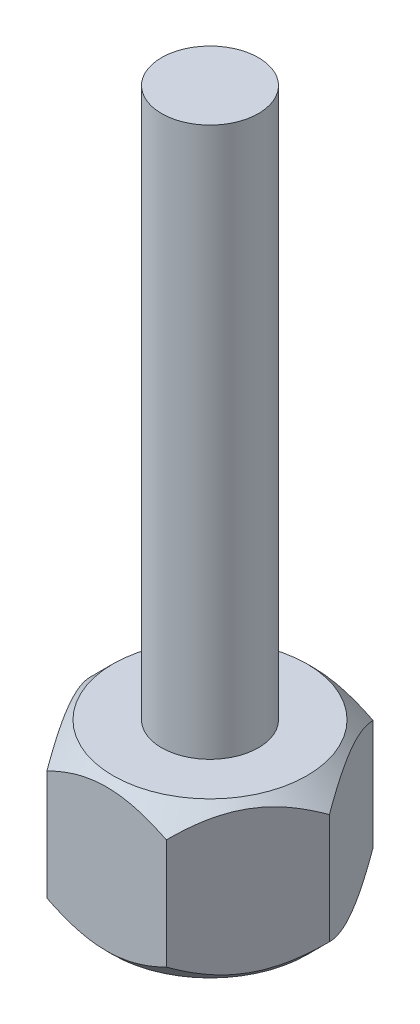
ISO-10303-21;
HEADER;
FILE_DESCRIPTION(('STEP AP214'),'2;1');
FILE_NAME('part.step','',(''),(''),'','','');
FILE_SCHEMA(('AUTOMOTIVE_DESIGN { 1 0 10303 214 1 1 1 1 }'));
ENDSEC;
DATA;
#1=APPLICATION_CONTEXT('core data for automotive mechanical design processes');
#2=APPLICATION_PROTOCOL_DEFINITION('international standard','automotive_design',2000,#1);
#3=PRODUCT_CONTEXT('',#1,'mechanical');
#4=PRODUCT('Part','Part','',(#3));
#5=PRODUCT_RELATED_PRODUCT_CATEGORY('part','',(#4));
#6=PRODUCT_DEFINITION_FORMATION('','',#4);
#7=PRODUCT_DEFINITION_CONTEXT('part definition',#1,'design');
#8=PRODUCT_DEFINITION('design','',#6,#7);
#9=PRODUCT_DEFINITION_SHAPE('','',#8);
#10=(LENGTH_UNIT() NAMED_UNIT(*) SI_UNIT(.MILLI.,.METRE.));
#11=(NAMED_UNIT(*) PLANE_ANGLE_UNIT() SI_UNIT($,.RADIAN.));
#12=(NAMED_UNIT(*) SI_UNIT($,.STERADIAN.) SOLID_ANGLE_UNIT());
#13=UNCERTAINTY_MEASURE_WITH_UNIT(LENGTH_MEASURE(1.E-05),#10,'distance_accuracy_value','');
#14=(GEOMETRIC_REPRESENTATION_CONTEXT(3) GLOBAL_UNCERTAINTY_ASSIGNED_CONTEXT((#13)) GLOBAL_UNIT_ASSIGNED_CONTEXT((#10,
#11,#12)) REPRESENTATION_CONTEXT('',''));
#15=CARTESIAN_POINT('',(0.,0.,0.));
#16=DIRECTION('',(0.,0.,1.));
#17=DIRECTION('',(1.,0.,0.));
#18=AXIS2_PLACEMENT_3D('',#15,#16,#17);
#19=CARTESIAN_POINT('',(2.30940107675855,3.,3.99999999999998));
#20=DIRECTION('',(-0.866025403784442,0.,-0.499999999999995));
#21=DIRECTION('',(-0.499999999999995,0.,0.866025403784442));
#22=AXIS2_PLACEMENT_3D('',#19,#20,#21);
#23=PLANE('',#22);
#24=CARTESIAN_POINT('',(4.61891762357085,-2.13108237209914,-0.0002));
#25=CARTESIAN_POINT('',(4.57920690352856,-2.17078899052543,0.0685809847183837));
#26=CARTESIAN_POINT('',(4.53919230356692,-2.20927742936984,0.137888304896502));
#27=CARTESIAN_POINT('',(4.45849274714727,-2.28344662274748,0.277664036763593));
#28=CARTESIAN_POINT('',(4.41780743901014,-2.31912584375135,0.348133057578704));
#29=CARTESIAN_POINT('',(4.29427352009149,-2.421696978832,0.5621000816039));
#30=CARTESIAN_POINT('',(4.21037499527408,-2.48368473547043,0.707416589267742));
#31=CARTESIAN_POINT('',(4.04121970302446,-2.58984197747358,1.00040214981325));
#32=CARTESIAN_POINT('',(3.95600566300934,-2.63427879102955,1.14799719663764));
#33=CARTESIAN_POINT('',(3.7836959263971,-2.70274886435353,1.44644641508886));
#34=CARTESIAN_POINT('',(3.69660550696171,-2.72683320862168,1.59729144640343));
#35=CARTESIAN_POINT('',(3.54650860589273,-2.74856296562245,1.85726690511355));
#36=CARTESIAN_POINT('',(3.48369550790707,-2.75177893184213,1.96606238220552));
#37=CARTESIAN_POINT('',(3.35817126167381,-2.74635778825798,2.18347675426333));
#38=CARTESIAN_POINT('',(3.2954601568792,-2.73771652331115,2.29209557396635));
#39=CARTESIAN_POINT('',(3.17063214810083,-2.70907380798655,2.50830402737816));
#40=CARTESIAN_POINT('',(3.10851598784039,-2.68905965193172,2.61589237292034));
#41=CARTESIAN_POINT('',(2.98535047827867,-2.63876368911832,2.82922129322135));
#42=CARTESIAN_POINT('',(2.92430104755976,-2.60848266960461,2.93496200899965));
#43=CARTESIAN_POINT('',(2.81592361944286,-2.54618259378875,3.12267722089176));
#44=CARTESIAN_POINT('',(2.76835567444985,-2.51580156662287,3.20506731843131));
#45=CARTESIAN_POINT('',(2.67407371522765,-2.45014338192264,3.36836846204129));
#46=CARTESIAN_POINT('',(2.62735972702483,-2.4148660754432,3.44927946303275));
#47=CARTESIAN_POINT('',(2.53493285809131,-2.34020615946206,3.60936749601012));
#48=CARTESIAN_POINT('',(2.48921734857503,-2.30083645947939,3.68854908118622));
#49=CARTESIAN_POINT('',(2.3986329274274,-2.21850873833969,3.84544590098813));
#50=CARTESIAN_POINT('',(2.35376351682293,-2.17555291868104,3.92316199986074));
#51=CARTESIAN_POINT('',(2.30928560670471,-2.13108237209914,4.00019999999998));
#52=B_SPLINE_CURVE_WITH_KNOTS('',3,(#24,#25,#26,#27,#28,#29,#30,#31,#32,#33,#34,#35,#36,#37,#38,
#39,#40,#41,#42,#43,#44,#45,#46,#47,#48,#49,#50,#51),.UNSPECIFIED.,.F.,.F.,(4,2,2,2,2,2,2,2,2,2,
2,2,2,4),(0.,0.266361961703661,0.532868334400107,1.06875865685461,1.59613884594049,
2.12219135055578,2.49866160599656,2.87526382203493,3.25228760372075,3.62928248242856,
3.92874944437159,4.22822551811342,4.52678401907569,4.82516056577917),.UNSPECIFIED.);
#53=CARTESIAN_POINT('',(4.61880215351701,-2.13119784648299,0.));
#54=VERTEX_POINT('',#53);
#55=CARTESIAN_POINT('',(2.30940107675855,-2.13119784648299,3.99999999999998));
#56=VERTEX_POINT('',#55);
#57=EDGE_CURVE('E51',#54,#56,#52,.T.);
#58=ORIENTED_EDGE('',*,*,#57,.F.);
#59=DIRECTION('',(0.,-1.,0.));
#60=VECTOR('',#59,1.);
#61=CARTESIAN_POINT('',(4.61880215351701,3.,0.));
#62=LINE('',#61,#60);
#63=CARTESIAN_POINT('',(4.61880215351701,2.13119784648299,0.));
#64=VERTEX_POINT('',#63);
#65=EDGE_CURVE('E39',#64,#54,#62,.T.);
#66=ORIENTED_EDGE('',*,*,#65,.F.);
#67=CARTESIAN_POINT('',(2.30928560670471,2.13108237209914,4.00019999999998));
#68=CARTESIAN_POINT('',(2.348996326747,2.17078899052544,3.93141901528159));
#69=CARTESIAN_POINT('',(2.38901092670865,2.20927742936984,3.86211169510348));
#70=CARTESIAN_POINT('',(2.46971048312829,2.28344662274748,3.72233596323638));
#71=CARTESIAN_POINT('',(2.51039579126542,2.31912584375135,3.65186694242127));
#72=CARTESIAN_POINT('',(2.63392971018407,2.421696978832,3.43789991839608));
#73=CARTESIAN_POINT('',(2.71782823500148,2.48368473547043,3.29258341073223));
#74=CARTESIAN_POINT('',(2.88698352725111,2.58984197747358,2.99959785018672));
#75=CARTESIAN_POINT('',(2.97219756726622,2.63427879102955,2.85200280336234));
#76=CARTESIAN_POINT('',(3.14450730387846,2.70274886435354,2.55355358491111));
#77=CARTESIAN_POINT('',(3.23159772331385,2.72683320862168,2.40270855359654));
#78=CARTESIAN_POINT('',(3.38169462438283,2.74856296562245,2.14273309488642));
#79=CARTESIAN_POINT('',(3.44450772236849,2.75177893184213,2.03393761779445));
#80=CARTESIAN_POINT('',(3.57003196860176,2.74635778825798,1.81652324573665));
#81=CARTESIAN_POINT('',(3.63274307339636,2.73771652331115,1.70790442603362));
#82=CARTESIAN_POINT('',(3.75757108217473,2.70907380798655,1.49169597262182));
#83=CARTESIAN_POINT('',(3.81968724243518,2.68905965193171,1.38410762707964));
#84=CARTESIAN_POINT('',(3.9428527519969,2.63876368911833,1.17077870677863));
#85=CARTESIAN_POINT('',(4.0039021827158,2.60848266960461,1.06503799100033));
#86=CARTESIAN_POINT('',(4.1122796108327,2.54618259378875,0.877322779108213));
#87=CARTESIAN_POINT('',(4.15984755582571,2.51580156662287,0.794932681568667));
#88=CARTESIAN_POINT('',(4.25412951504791,2.45014338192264,0.631631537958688));
#89=CARTESIAN_POINT('',(4.30084350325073,2.4148660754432,0.550720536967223));
#90=CARTESIAN_POINT('',(4.39327037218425,2.34020615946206,0.390632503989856));
#91=CARTESIAN_POINT('',(4.43898588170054,2.30083645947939,0.311450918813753));
#92=CARTESIAN_POINT('',(4.52957030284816,2.2185087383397,0.15455409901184));
#93=CARTESIAN_POINT('',(4.57443971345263,2.17555291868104,0.0768380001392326));
#94=CARTESIAN_POINT('',(4.61891762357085,2.13108237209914,-0.000200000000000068));
#95=B_SPLINE_CURVE_WITH_KNOTS('',3,(#67,#68,#69,#70,#71,#72,#73,#74,#75,#76,#77,#78,#79,#80,#81,
#82,#83,#84,#85,#86,#87,#88,#89,#90,#91,#92,#93,#94),.UNSPECIFIED.,.F.,.F.,(4,2,2,2,2,2,2,2,2,2,
2,2,2,4),(0.,0.266361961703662,0.532868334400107,1.06875865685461,1.59613884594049,
2.12219135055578,2.49866160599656,2.87526382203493,3.25228760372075,3.62928248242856,
3.92874944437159,4.22822551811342,4.5267840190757,4.82516056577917),.UNSPECIFIED.);
#96=CARTESIAN_POINT('',(2.30940107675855,2.13119784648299,3.99999999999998));
#97=VERTEX_POINT('',#96);
#98=EDGE_CURVE('E112',#97,#64,#95,.T.);
#99=ORIENTED_EDGE('',*,*,#98,.F.);
#100=DIRECTION('',(0.,-1.,0.));
#101=VECTOR('',#100,1.);
#102=CARTESIAN_POINT('',(2.30940107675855,3.,3.99999999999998));
#103=LINE('',#102,#101);
#104=EDGE_CURVE('E108',#97,#56,#103,.T.);
#105=ORIENTED_EDGE('',*,*,#104,.T.);
#106=EDGE_LOOP('',(#58,#66,#99,#105));
#107=FACE_BOUND('',#106,.T.);
#108=ADVANCED_FACE('F35',(#107),#23,.F.);
#109=CARTESIAN_POINT('',(4.61880215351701,3.,0.));
#110=DIRECTION('',(-0.866025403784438,0.,0.500000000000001));
#111=DIRECTION('',(0.500000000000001,0.,0.866025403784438));
#112=AXIS2_PLACEMENT_3D('',#109,#110,#111);
#113=PLANE('',#112);
#114=CARTESIAN_POINT('',(2.30928560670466,-2.13108237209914,-4.00020000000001));
#115=CARTESIAN_POINT('',(2.34899632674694,-2.17078899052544,-3.93141901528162));
#116=CARTESIAN_POINT('',(2.38901092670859,-2.20927742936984,-3.86211169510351));
#117=CARTESIAN_POINT('',(2.46971048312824,-2.28344662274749,-3.72233596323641));
#118=CARTESIAN_POINT('',(2.51039579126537,-2.31912584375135,-3.6518669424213));
#119=CARTESIAN_POINT('',(2.63392971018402,-2.421696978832,-3.4378999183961));
#120=CARTESIAN_POINT('',(2.71782823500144,-2.48368473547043,-3.29258341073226));
#121=CARTESIAN_POINT('',(2.88698352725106,-2.58984197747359,-2.99959785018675));
#122=CARTESIAN_POINT('',(2.97219756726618,-2.63427879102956,-2.85200280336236));
#123=CARTESIAN_POINT('',(3.14450730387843,-2.70274886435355,-2.55355358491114));
#124=CARTESIAN_POINT('',(3.23159772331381,-2.72683320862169,-2.40270855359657));
#125=CARTESIAN_POINT('',(3.3816946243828,-2.74856296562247,-2.14273309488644));
#126=CARTESIAN_POINT('',(3.44450772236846,-2.75177893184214,-2.03393761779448));
#127=CARTESIAN_POINT('',(3.57003196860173,-2.746357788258,-1.81652324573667));
#128=CARTESIAN_POINT('',(3.63274307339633,-2.73771652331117,-1.70790442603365));
#129=CARTESIAN_POINT('',(3.7575710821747,-2.70907380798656,-1.49169597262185));
#130=CARTESIAN_POINT('',(3.81968724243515,-2.68905965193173,-1.38410762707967));
#131=CARTESIAN_POINT('',(3.94285275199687,-2.63876368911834,-1.17077870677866));
#132=CARTESIAN_POINT('',(4.00390218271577,-2.60848266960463,-1.06503799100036));
#133=CARTESIAN_POINT('',(4.11227961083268,-2.54618259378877,-0.877322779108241));
#134=CARTESIAN_POINT('',(4.15984755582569,-2.51580156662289,-0.794932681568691));
#135=CARTESIAN_POINT('',(4.25412951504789,-2.45014338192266,-0.631631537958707));
#136=CARTESIAN_POINT('',(4.30084350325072,-2.41486607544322,-0.550720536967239));
#137=CARTESIAN_POINT('',(4.39327037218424,-2.34020615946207,-0.390632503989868));
#138=CARTESIAN_POINT('',(4.43898588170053,-2.3008364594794,-0.311450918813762));
#139=CARTESIAN_POINT('',(4.52957030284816,-2.2185087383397,-0.154554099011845));
#140=CARTESIAN_POINT('',(4.57443971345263,-2.17555291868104,-0.0768380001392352));
#141=CARTESIAN_POINT('',(4.61891762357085,-2.13108237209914,0.000200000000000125));
#142=B_SPLINE_CURVE_WITH_KNOTS('',3,(#114,#115,#116,#117,#118,#119,#120,#121,#122,#123,#124,
#125,#126,#127,#128,#129,#130,#131,#132,#133,#134,#135,#136,#137,#138,#139,#140,#141),
.UNSPECIFIED.,.F.,.F.,(4,2,2,2,2,2,2,2,2,2,2,2,2,4),(0.,0.266361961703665,0.532868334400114,
1.06875865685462,1.59613884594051,2.12219135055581,2.49866160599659,2.87526382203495,
3.25228760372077,3.62928248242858,3.92874944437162,4.22822551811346,4.52678401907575,
4.82516056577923),.UNSPECIFIED.);
#143=CARTESIAN_POINT('',(2.3094010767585,-2.13119784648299,-4.00000000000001));
#144=VERTEX_POINT('',#143);
#145=EDGE_CURVE('E129',#144,#54,#142,.T.);
#146=ORIENTED_EDGE('',*,*,#145,.F.);
#147=DIRECTION('',(0.,-1.,0.));
#148=VECTOR('',#147,1.);
#149=CARTESIAN_POINT('',(2.3094010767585,3.,-4.00000000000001));
#150=LINE('',#149,#148);
#151=CARTESIAN_POINT('',(2.3094010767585,2.13119784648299,-4.00000000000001));
#152=VERTEX_POINT('',#151);
#153=EDGE_CURVE('E117',#152,#144,#150,.T.);
#154=ORIENTED_EDGE('',*,*,#153,.F.);
#155=CARTESIAN_POINT('',(4.61891762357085,2.13108237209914,0.000200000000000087));
#156=CARTESIAN_POINT('',(4.57920690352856,2.17078899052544,-0.0685809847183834));
#157=CARTESIAN_POINT('',(4.53919230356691,2.20927742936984,-0.137888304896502));
#158=CARTESIAN_POINT('',(4.45849274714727,2.28344662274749,-0.277664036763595));
#159=CARTESIAN_POINT('',(4.41780743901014,2.31912584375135,-0.348133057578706));
#160=CARTESIAN_POINT('',(4.29427352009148,2.421696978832,-0.562100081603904));
#161=CARTESIAN_POINT('',(4.21037499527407,2.48368473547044,-0.707416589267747));
#162=CARTESIAN_POINT('',(4.04121970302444,2.58984197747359,-1.00040214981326));
#163=CARTESIAN_POINT('',(3.95600566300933,2.63427879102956,-1.14799719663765));
#164=CARTESIAN_POINT('',(3.78369592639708,2.70274886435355,-1.44644641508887));
#165=CARTESIAN_POINT('',(3.69660550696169,2.72683320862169,-1.59729144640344));
#166=CARTESIAN_POINT('',(3.54650860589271,2.74856296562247,-1.85726690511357));
#167=CARTESIAN_POINT('',(3.48369550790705,2.75177893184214,-1.96606238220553));
#168=CARTESIAN_POINT('',(3.35817126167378,2.746357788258,-2.18347675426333));
#169=CARTESIAN_POINT('',(3.29546015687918,2.73771652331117,-2.29209557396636));
#170=CARTESIAN_POINT('',(3.1706321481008,2.70907380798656,-2.50830402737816));
#171=CARTESIAN_POINT('',(3.10851598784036,2.68905965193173,-2.61589237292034));
#172=CARTESIAN_POINT('',(2.98535047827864,2.63876368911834,-2.82922129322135));
#173=CARTESIAN_POINT('',(2.92430104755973,2.60848266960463,-2.93496200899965));
#174=CARTESIAN_POINT('',(2.81592361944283,2.54618259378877,-3.12267722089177));
#175=CARTESIAN_POINT('',(2.76835567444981,2.51580156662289,-3.20506731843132));
#176=CARTESIAN_POINT('',(2.67407371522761,2.45014338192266,-3.3683684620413));
#177=CARTESIAN_POINT('',(2.62735972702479,2.41486607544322,-3.44927946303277));
#178=CARTESIAN_POINT('',(2.53493285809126,2.34020615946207,-3.60936749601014));
#179=CARTESIAN_POINT('',(2.48921734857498,2.3008364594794,-3.68854908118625));
#180=CARTESIAN_POINT('',(2.39863292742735,2.2185087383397,-3.84544590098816));
#181=CARTESIAN_POINT('',(2.35376351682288,2.17555291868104,-3.92316199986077));
#182=CARTESIAN_POINT('',(2.30928560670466,2.13108237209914,-4.00020000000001));
#183=B_SPLINE_CURVE_WITH_KNOTS('',3,(#155,#156,#157,#158,#159,#160,#161,#162,#163,#164,#165,
#166,#167,#168,#169,#170,#171,#172,#173,#174,#175,#176,#177,#178,#179,#180,#181,#182),
.UNSPECIFIED.,.F.,.F.,(4,2,2,2,2,2,2,2,2,2,2,2,2,4),(0.,0.266361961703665,0.532868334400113,
1.06875865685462,1.59613884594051,2.12219135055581,2.49866160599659,2.87526382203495,
3.25228760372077,3.62928248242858,3.92874944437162,4.22822551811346,4.52678401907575,
4.82516056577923),.UNSPECIFIED.);
#184=EDGE_CURVE('E130',#64,#152,#183,.T.);
#185=ORIENTED_EDGE('',*,*,#184,.F.);
#186=ORIENTED_EDGE('',*,*,#65,.T.);
#187=EDGE_LOOP('',(#146,#154,#185,#186));
#188=FACE_BOUND('',#187,.T.);
#189=ADVANCED_FACE('F128',(#188),#113,.F.);
#190=CARTESIAN_POINT('',(2.3094010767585,3.,-4.00000000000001));
#191=DIRECTION('',(0.,0.,1.));
#192=DIRECTION('',(1.,0.,0.));
#193=AXIS2_PLACEMENT_3D('',#190,#191,#192);
#194=PLANE('',#193);
#195=CARTESIAN_POINT('',(-9.37192628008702,3.43984799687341,-3.99999999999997));
#196=CARTESIAN_POINT('',(-9.2330585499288,3.31212924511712,-3.99999999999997));
#197=CARTESIAN_POINT('',(-9.09397545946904,3.18464475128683,-3.99999999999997));
#198=CARTESIAN_POINT('',(-8.81531550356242,2.93021448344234,-3.99999999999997));
#199=CARTESIAN_POINT('',(-8.67573863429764,2.80326871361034,-3.99999999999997));
#200=CARTESIAN_POINT('',(-8.25611326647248,2.42329094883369,-3.99999999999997));
#201=CARTESIAN_POINT('',(-7.97523225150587,2.1711758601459,-3.99999999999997));
#202=CARTESIAN_POINT('',(-7.40883160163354,1.66864593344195,-3.99999999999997));
#203=CARTESIAN_POINT('',(-7.12329401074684,1.41825130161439,-3.99999999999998));
#204=CARTESIAN_POINT('',(-6.54834228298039,0.922002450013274,-3.99999999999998));
#205=CARTESIAN_POINT('',(-6.25892861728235,0.676147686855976,-3.99999999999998));
#206=CARTESIAN_POINT('',(-5.72775751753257,0.23495048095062,-3.99999999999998));
#207=CARTESIAN_POINT('',(-5.48688787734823,0.0385413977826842,-3.99999999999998));
#208=CARTESIAN_POINT('',(-5.00029824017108,-0.348352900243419,-3.99999999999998));
#209=CARTESIAN_POINT('',(-4.75457704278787,-0.538836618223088,-3.99999999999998));
#210=CARTESIAN_POINT('',(-4.38127729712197,-0.817981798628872,-3.99999999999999));
#211=CARTESIAN_POINT('',(-4.25612491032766,-0.909886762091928,-3.99999999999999));
#212=CARTESIAN_POINT('',(-4.00392395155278,-1.09105209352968,-3.99999999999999));
#213=CARTESIAN_POINT('',(-3.87687547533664,-1.18031259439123,-3.99999999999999));
#214=CARTESIAN_POINT('',(-3.62061728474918,-1.35554595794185,-3.99999999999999));
#215=CARTESIAN_POINT('',(-3.4914086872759,-1.44152044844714,-3.99999999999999));
#216=CARTESIAN_POINT('',(-3.2303725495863,-1.60944404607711,-3.99999999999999));
#217=CARTESIAN_POINT('',(-3.09854476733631,-1.69139277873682,-3.99999999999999));
#218=CARTESIAN_POINT('',(-2.83307139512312,-1.84948731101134,-3.99999999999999));
#219=CARTESIAN_POINT('',(-2.69945353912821,-1.9256794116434,-3.99999999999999));
#220=CARTESIAN_POINT('',(-2.4288209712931,-2.07173149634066,-3.99999999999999));
#221=CARTESIAN_POINT('',(-2.29180721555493,-2.14159323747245,-3.99999999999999));
#222=CARTESIAN_POINT('',(-2.01405248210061,-2.27323049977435,-3.99999999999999));
#223=CARTESIAN_POINT('',(-1.87331470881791,-2.33501271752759,-3.99999999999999));
#224=CARTESIAN_POINT('',(-1.58777052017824,-2.44838754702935,-3.99999999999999));
#225=CARTESIAN_POINT('',(-1.44296529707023,-2.49998310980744,-3.99999999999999));
#226=CARTESIAN_POINT('',(-1.18047638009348,-2.58089763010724,-4.));
#227=CARTESIAN_POINT('',(-1.06353784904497,-2.61262015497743,-4.));
#228=CARTESIAN_POINT('',(-0.82753855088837,-2.6669072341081,-4.));
#229=CARTESIAN_POINT('',(-0.70847807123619,-2.68947301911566,-4.));
#230=CARTESIAN_POINT('',(-0.469186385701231,-2.72431072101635,-4.));
#231=CARTESIAN_POINT('',(-0.348959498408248,-2.73661187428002,-4.));
#232=CARTESIAN_POINT('',(-0.107880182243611,-2.75035483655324,-4.));
#233=CARTESIAN_POINT('',(0.012972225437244,-2.75179701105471,-4.));
#234=CARTESIAN_POINT('',(0.254407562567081,-2.74373599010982,-4.));
#235=CARTESIAN_POINT('',(0.374990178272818,-2.73422355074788,-4.));
#236=CARTESIAN_POINT('',(0.614864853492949,-2.70477074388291,-4.));
#237=CARTESIAN_POINT('',(0.734156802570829,-2.68482949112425,-4.));
#238=CARTESIAN_POINT('',(0.971105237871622,-2.63544444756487,-4.));
#239=CARTESIAN_POINT('',(1.08875571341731,-2.60597220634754,-4.));
#240=CARTESIAN_POINT('',(1.32164948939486,-2.53878672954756,-4.00000000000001));
#241=CARTESIAN_POINT('',(1.43689277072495,-2.50107342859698,-4.00000000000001));
#242=CARTESIAN_POINT('',(1.68681713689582,-2.41072883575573,-4.00000000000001));
#243=CARTESIAN_POINT('',(1.82096176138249,-2.35662322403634,-4.00000000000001));
#244=CARTESIAN_POINT('',(2.08577423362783,-2.24042298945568,-4.00000000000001));
#245=CARTESIAN_POINT('',(2.21644042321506,-2.17832463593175,-4.00000000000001));
#246=CARTESIAN_POINT('',(2.47476816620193,-2.04765584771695,-4.00000000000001));
#247=CARTESIAN_POINT('',(2.60242384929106,-1.97907389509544,-4.00000000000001));
#248=CARTESIAN_POINT('',(2.85483193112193,-1.83683396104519,-4.00000000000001));
#249=CARTESIAN_POINT('',(2.9795847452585,-1.76317671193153,-4.00000000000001));
#250=CARTESIAN_POINT('',(3.22804145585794,-1.61088522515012,-4.00000000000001));
#251=CARTESIAN_POINT('',(3.35171540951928,-1.53220235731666,-4.00000000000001));
#252=CARTESIAN_POINT('',(3.59684142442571,-1.37145666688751,-4.00000000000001));
#253=CARTESIAN_POINT('',(3.71829342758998,-1.28939375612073,-4.00000000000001));
#254=CARTESIAN_POINT('',(4.07953953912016,-1.03928032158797,-4.00000000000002));
#255=CARTESIAN_POINT('',(4.31649650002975,-0.867134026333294,-4.00000000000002));
#256=CARTESIAN_POINT('',(4.76717361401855,-0.528614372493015,-4.00000000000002));
#257=CARTESIAN_POINT('',(4.98130234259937,-0.362778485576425,-4.00000000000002));
#258=CARTESIAN_POINT('',(5.40586225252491,-0.0264172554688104,-4.00000000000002));
#259=CARTESIAN_POINT('',(5.61629315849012,0.144108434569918,-4.00000000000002));
#260=CARTESIAN_POINT('',(6.03439697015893,0.488781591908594,-4.00000000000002));
#261=CARTESIAN_POINT('',(6.24206790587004,0.662931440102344,-4.00000000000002));
#262=CARTESIAN_POINT('',(6.65511320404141,1.01393518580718,-4.00000000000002));
#263=CARTESIAN_POINT('',(6.86048753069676,1.19078912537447,-4.00000000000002));
#264=CARTESIAN_POINT('',(7.25997549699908,1.53842692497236,-4.00000000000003));
#265=CARTESIAN_POINT('',(7.45417227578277,1.70911541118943,-4.00000000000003));
#266=CARTESIAN_POINT('',(7.84118515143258,2.05205369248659,-4.00000000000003));
#267=CARTESIAN_POINT('',(8.03400123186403,2.22430350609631,-4.00000000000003));
#268=CARTESIAN_POINT('',(8.41822009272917,2.56983726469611,-4.00000000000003));
#269=CARTESIAN_POINT('',(8.60962446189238,2.74311944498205,-4.00000000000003));
#270=CARTESIAN_POINT('',(8.99145979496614,3.09074118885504,-4.00000000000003));
#271=CARTESIAN_POINT('',(9.18189078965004,3.26508071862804,-4.00000000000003));
#272=CARTESIAN_POINT('',(9.371926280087,3.43984799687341,-4.00000000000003));
#273=B_SPLINE_CURVE_WITH_KNOTS('',3,(#195,#196,#197,#198,#199,#200,#201,#202,#203,#204,#205,
#206,#207,#208,#209,#210,#211,#212,#213,#214,#215,#216,#217,#218,#219,#220,#221,#222,#223,#224,
#225,#226,#227,#228,#229,#230,#231,#232,#233,#234,#235,#236,#237,#238,#239,#240,#241,#242,#243,
#244,#245,#246,#247,#248,#249,#250,#251,#252,#253,#254,#255,#256,#257,#258,#259,#260,#261,#262,
#263,#264,#265,#266,#267,#268,#269,#270,#271,#272),.UNSPECIFIED.,.F.,.F.,(4,2,2,2,2,2,2,2,2,2,2,
2,2,2,2,2,2,2,2,2,2,2,2,2,2,2,2,2,2,2,2,2,2,2,2,2,2,2,4),(0.,0.566009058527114,1.13202250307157,
2.26430331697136,3.40359801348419,4.54275545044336,5.47508711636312,6.40765242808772,
6.87344446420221,7.33921305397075,7.80474784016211,8.27032584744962,8.73163676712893,
9.19281924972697,9.65361703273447,10.1142811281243,10.4774621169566,10.8405942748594,
11.2026885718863,11.5647706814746,11.9271585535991,12.2895771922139,12.6530878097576,
13.0166013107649,13.4502040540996,13.8840099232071,14.3186014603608,14.7531304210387,
15.1928080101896,15.6324970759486,16.5109103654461,17.3233499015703,18.1358496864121,
18.948901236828,19.761965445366,20.5375988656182,21.313241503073,22.0878088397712,
22.86235153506),.UNSPECIFIED.);
#274=CARTESIAN_POINT('',(-2.30940107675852,-2.13119784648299,-3.99999999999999));
#275=VERTEX_POINT('',#274);
#276=EDGE_CURVE('E137',#275,#144,#273,.T.);
#277=ORIENTED_EDGE('',*,*,#276,.F.);
#278=DIRECTION('',(0.,-1.,0.));
#279=VECTOR('',#278,1.);
#280=CARTESIAN_POINT('',(-2.30940107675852,3.,-3.99999999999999));
#281=LINE('',#280,#279);
#282=CARTESIAN_POINT('',(-2.30940107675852,2.13119784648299,-3.99999999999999));
#283=VERTEX_POINT('',#282);
#284=EDGE_CURVE('E110',#283,#275,#281,.T.);
#285=ORIENTED_EDGE('',*,*,#284,.F.);
#286=CARTESIAN_POINT('',(9.24123112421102,-3.31977421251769,-4.00000000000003));
#287=CARTESIAN_POINT('',(9.10474543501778,-3.19452087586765,-4.00000000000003));
#288=CARTESIAN_POINT('',(8.96804419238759,-3.06950252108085,-4.00000000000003));
#289=CARTESIAN_POINT('',(8.6941479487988,-2.82000575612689,-4.00000000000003));
#290=CARTESIAN_POINT('',(8.55695294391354,-2.69552735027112,-4.00000000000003));
#291=CARTESIAN_POINT('',(8.14447344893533,-2.32295300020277,-4.00000000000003));
#292=CARTESIAN_POINT('',(7.86835709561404,-2.07577550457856,-4.00000000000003));
#293=CARTESIAN_POINT('',(7.31145809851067,-1.5830935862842,-4.00000000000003));
#294=CARTESIAN_POINT('',(7.03065686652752,-1.33761014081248,-4.00000000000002));
#295=CARTESIAN_POINT('',(6.4651964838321,-0.851177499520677,-4.00000000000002));
#296=CARTESIAN_POINT('',(6.18053781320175,-0.610227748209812,-4.00000000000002));
#297=CARTESIAN_POINT('',(5.65574585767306,-0.176017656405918,-4.00000000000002));
#298=CARTESIAN_POINT('',(5.41645812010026,0.0182624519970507,-4.00000000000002));
#299=CARTESIAN_POINT('',(4.93297659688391,0.400804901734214,-4.00000000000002));
#300=CARTESIAN_POINT('',(4.68878154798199,0.589065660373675,-4.00000000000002));
#301=CARTESIAN_POINT('',(4.31772808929,0.864764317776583,-4.00000000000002));
#302=CARTESIAN_POINT('',(4.19332064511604,0.955499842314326,-4.00000000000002));
#303=CARTESIAN_POINT('',(3.94259213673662,1.13428207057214,-4.00000000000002));
#304=CARTESIAN_POINT('',(3.81627117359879,1.22232891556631,-4.00000000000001));
#305=CARTESIAN_POINT('',(3.5614521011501,1.39507944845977,-4.00000000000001));
#306=CARTESIAN_POINT('',(3.4329551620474,1.47978485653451,-4.00000000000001));
#307=CARTESIAN_POINT('',(3.17332563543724,1.64510328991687,-4.00000000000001));
#308=CARTESIAN_POINT('',(3.04219280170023,1.72571593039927,-4.00000000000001));
#309=CARTESIAN_POINT('',(2.7784442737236,1.88086128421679,-4.00000000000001));
#310=CARTESIAN_POINT('',(2.64586445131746,1.95545462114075,-4.00000000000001));
#311=CARTESIAN_POINT('',(2.37732787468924,2.09825186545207,-4.00000000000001));
#312=CARTESIAN_POINT('',(2.24137209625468,2.16645759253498,-4.00000000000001));
#313=CARTESIAN_POINT('',(1.96579448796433,2.29472331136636,-4.00000000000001));
#314=CARTESIAN_POINT('',(1.826176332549,2.3547911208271,-4.00000000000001));
#315=CARTESIAN_POINT('',(1.54295282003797,2.46471170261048,-4.00000000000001));
#316=CARTESIAN_POINT('',(1.39934862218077,2.51456741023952,-4.00000000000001));
#317=CARTESIAN_POINT('',(1.1383613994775,2.59262927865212,-4.));
#318=CARTESIAN_POINT('',(1.02168368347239,2.62317999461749,-4.));
#319=CARTESIAN_POINT('',(0.78628273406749,2.67506759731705,-4.));
#320=CARTESIAN_POINT('',(0.66755978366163,2.69640574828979,-4.));
#321=CARTESIAN_POINT('',(0.429022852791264,2.72878816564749,-4.));
#322=CARTESIAN_POINT('',(0.30921265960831,2.73985992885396,-4.));
#323=CARTESIAN_POINT('',(0.069076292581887,2.75120115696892,-4.));
#324=CARTESIAN_POINT('',(-0.0512498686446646,2.75147088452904,-4.));
#325=CARTESIAN_POINT('',(-0.291448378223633,2.74119234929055,-4.));
#326=CARTESIAN_POINT('',(-0.411320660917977,2.73064257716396,-4.));
#327=CARTESIAN_POINT('',(-0.649708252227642,2.69930275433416,-4.));
#328=CARTESIAN_POINT('',(-0.768223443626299,2.67851182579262,-4.));
#329=CARTESIAN_POINT('',(-1.00358097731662,2.6276312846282,-4.));
#330=CARTESIAN_POINT('',(-1.12041733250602,2.5975143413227,-4.));
#331=CARTESIAN_POINT('',(-1.35168455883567,2.52923731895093,-3.99999999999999));
#332=CARTESIAN_POINT('',(-1.46611544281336,2.49107728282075,-3.99999999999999));
#333=CARTESIAN_POINT('',(-1.71795568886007,2.39859504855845,-3.99999999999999));
#334=CARTESIAN_POINT('',(-1.8547354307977,2.34256845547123,-3.99999999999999));
#335=CARTESIAN_POINT('',(-2.12468485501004,2.22234420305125,-3.99999999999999));
#336=CARTESIAN_POINT('',(-2.25785277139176,2.15814263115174,-3.99999999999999));
#337=CARTESIAN_POINT('',(-2.52107126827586,2.02316030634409,-3.99999999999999));
#338=CARTESIAN_POINT('',(-2.65111617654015,1.95236857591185,-3.99999999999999));
#339=CARTESIAN_POINT('',(-2.90827242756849,1.80561922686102,-3.99999999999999));
#340=CARTESIAN_POINT('',(-3.03538318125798,1.72966058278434,-3.99999999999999));
#341=CARTESIAN_POINT('',(-3.28838105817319,1.57279103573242,-3.99999999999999));
#342=CARTESIAN_POINT('',(-3.41424065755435,1.49183594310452,-3.99999999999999));
#343=CARTESIAN_POINT('',(-3.6637119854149,1.32652496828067,-3.99999999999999));
#344=CARTESIAN_POINT('',(-3.78732351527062,1.24216878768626,-3.99999999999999));
#345=CARTESIAN_POINT('',(-4.15534914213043,0.984935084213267,-3.99999999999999));
#346=CARTESIAN_POINT('',(-4.39688255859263,0.807937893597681,-3.99999999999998));
#347=CARTESIAN_POINT('',(-4.84150470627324,0.471288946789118,-3.99999999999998));
#348=CARTESIAN_POINT('',(-5.04532239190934,0.312588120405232,-3.99999999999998));
#349=CARTESIAN_POINT('',(-5.44960995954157,-0.00893629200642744,-3.99999999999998));
#350=CARTESIAN_POINT('',(-5.65008049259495,-0.171759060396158,-3.99999999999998));
#351=CARTESIAN_POINT('',(-6.04855278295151,-0.500679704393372,-3.99999999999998));
#352=CARTESIAN_POINT('',(-6.24655263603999,-0.666779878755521,-3.99999999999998));
#353=CARTESIAN_POINT('',(-6.64046554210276,-1.00145131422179,-3.99999999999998));
#354=CARTESIAN_POINT('',(-6.83637849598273,-1.17002269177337,-3.99999999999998));
#355=CARTESIAN_POINT('',(-7.21818704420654,-1.50189107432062,-3.99999999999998));
#356=CARTESIAN_POINT('',(-7.404153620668,-1.66510654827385,-3.99999999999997));
#357=CARTESIAN_POINT('',(-7.7747925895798,-1.99299381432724,-3.99999999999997));
#358=CARTESIAN_POINT('',(-7.95946500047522,-2.15766558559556,-3.99999999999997));
#359=CARTESIAN_POINT('',(-8.32750584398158,-2.4880066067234,-3.99999999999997));
#360=CARTESIAN_POINT('',(-8.51087559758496,-2.65367438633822,-3.99999999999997));
#361=CARTESIAN_POINT('',(-8.8766996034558,-2.98601660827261,-3.99999999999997));
#362=CARTESIAN_POINT('',(-9.05915385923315,-3.1526910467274,-3.99999999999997));
#363=CARTESIAN_POINT('',(-9.24123112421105,-3.31977421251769,-3.99999999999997));
#364=B_SPLINE_CURVE_WITH_KNOTS('',3,(#286,#287,#288,#289,#290,#291,#292,#293,#294,#295,#296,
#297,#298,#299,#300,#301,#302,#303,#304,#305,#306,#307,#308,#309,#310,#311,#312,#313,#314,#315,
#316,#317,#318,#319,#320,#321,#322,#323,#324,#325,#326,#327,#328,#329,#330,#331,#332,#333,#334,
#335,#336,#337,#338,#339,#340,#341,#342,#343,#344,#345,#346,#347,#348,#349,#350,#351,#352,#353,
#354,#355,#356,#357,#358,#359,#360,#361,#362,#363),.UNSPECIFIED.,.F.,.F.,(4,2,2,2,2,2,2,2,2,2,2,
2,2,2,2,2,2,2,2,2,2,2,2,2,2,2,2,2,2,2,2,2,2,2,2,2,2,2,4),(0.,0.555742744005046,1.11148991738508,
2.22323945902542,3.34213750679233,4.46089755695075,5.38551489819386,6.31037338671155,
6.77228903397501,7.23418036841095,7.6958307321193,8.15752442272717,8.6137585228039,
9.06986225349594,9.52552467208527,9.9810559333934,10.3425699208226,10.7040342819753,
11.0645277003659,11.425012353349,11.7855473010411,12.1461131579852,12.5077458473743,
12.8693766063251,13.3124593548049,13.7557549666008,14.1998026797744,14.64393878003,
15.092813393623,15.5417274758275,16.4398101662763,17.2147059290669,17.9894491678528,
18.7647566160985,19.5401007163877,20.2823893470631,21.0246673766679,21.7660354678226,
22.5074007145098),.UNSPECIFIED.);
#365=EDGE_CURVE('E197',#152,#283,#364,.T.);
#366=ORIENTED_EDGE('',*,*,#365,.F.);
#367=ORIENTED_EDGE('',*,*,#153,.T.);
#368=EDGE_LOOP('',(#277,#285,#366,#367));
#369=FACE_BOUND('',#368,.T.);
#370=ADVANCED_FACE('F189',(#369),#194,.F.);
#371=CARTESIAN_POINT('',(-2.30940107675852,3.,-3.99999999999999));
#372=DIRECTION('',(0.866025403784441,0.,0.499999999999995));
#373=DIRECTION('',(0.499999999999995,0.,-0.866025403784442));
#374=AXIS2_PLACEMENT_3D('',#371,#372,#373);
#375=PLANE('',#374);
#376=CARTESIAN_POINT('',(-4.61891762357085,-2.13108237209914,0.000200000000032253));
#377=CARTESIAN_POINT('',(-4.57920690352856,-2.17078899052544,-0.0685809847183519));
#378=CARTESIAN_POINT('',(-4.53919230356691,-2.20927742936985,-0.137888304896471));
#379=CARTESIAN_POINT('',(-4.45849274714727,-2.28344662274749,-0.277664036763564));
#380=CARTESIAN_POINT('',(-4.41780743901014,-2.31912584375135,-0.348133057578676));
#381=CARTESIAN_POINT('',(-4.29427352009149,-2.421696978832,-0.562100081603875));
#382=CARTESIAN_POINT('',(-4.21037499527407,-2.48368473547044,-0.707416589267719));
#383=CARTESIAN_POINT('',(-4.04121970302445,-2.58984197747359,-1.00040214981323));
#384=CARTESIAN_POINT('',(-3.95600566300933,-2.63427879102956,-1.14799719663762));
#385=CARTESIAN_POINT('',(-3.78369592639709,-2.70274886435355,-1.44644641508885));
#386=CARTESIAN_POINT('',(-3.6966055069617,-2.72683320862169,-1.59729144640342));
#387=CARTESIAN_POINT('',(-3.54650860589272,-2.74856296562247,-1.85726690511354));
#388=CARTESIAN_POINT('',(-3.48369550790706,-2.75177893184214,-1.96606238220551));
#389=CARTESIAN_POINT('',(-3.35817126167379,-2.746357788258,-2.18347675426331));
#390=CARTESIAN_POINT('',(-3.29546015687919,-2.73771652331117,-2.29209557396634));
#391=CARTESIAN_POINT('',(-3.17063214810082,-2.70907380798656,-2.50830402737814));
#392=CARTESIAN_POINT('',(-3.10851598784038,-2.68905965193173,-2.61589237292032));
#393=CARTESIAN_POINT('',(-2.98535047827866,-2.63876368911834,-2.82922129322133));
#394=CARTESIAN_POINT('',(-2.92430104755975,-2.60848266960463,-2.93496200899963));
#395=CARTESIAN_POINT('',(-2.81592361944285,-2.54618259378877,-3.12267722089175));
#396=CARTESIAN_POINT('',(-2.76835567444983,-2.51580156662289,-3.2050673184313));
#397=CARTESIAN_POINT('',(-2.67407371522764,-2.45014338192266,-3.36836846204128));
#398=CARTESIAN_POINT('',(-2.62735972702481,-2.41486607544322,-3.44927946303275));
#399=CARTESIAN_POINT('',(-2.53493285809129,-2.34020615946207,-3.60936749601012));
#400=CARTESIAN_POINT('',(-2.489217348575,-2.3008364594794,-3.68854908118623));
#401=CARTESIAN_POINT('',(-2.39863292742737,-2.2185087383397,-3.84544590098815));
#402=CARTESIAN_POINT('',(-2.3537635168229,-2.17555291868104,-3.92316199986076));
#403=CARTESIAN_POINT('',(-2.30928560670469,-2.13108237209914,-4.00019999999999));
#404=B_SPLINE_CURVE_WITH_KNOTS('',3,(#376,#377,#378,#379,#380,#381,#382,#383,#384,#385,#386,
#387,#388,#389,#390,#391,#392,#393,#394,#395,#396,#397,#398,#399,#400,#401,#402,#403),
.UNSPECIFIED.,.F.,.F.,(4,2,2,2,2,2,2,2,2,2,2,2,2,4),(0.,0.266361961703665,0.532868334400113,
1.06875865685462,1.59613884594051,2.12219135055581,2.49866160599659,2.87526382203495,
3.25228760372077,3.62928248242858,3.92874944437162,4.22822551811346,4.52678401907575,
4.82516056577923),.UNSPECIFIED.);
#405=CARTESIAN_POINT('',(-4.61880215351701,-2.13119784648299,0.));
#406=VERTEX_POINT('',#405);
#407=EDGE_CURVE('E104',#406,#275,#404,.T.);
#408=ORIENTED_EDGE('',*,*,#407,.F.);
#409=DIRECTION('',(0.,-1.,0.));
#410=VECTOR('',#409,1.);
#411=CARTESIAN_POINT('',(-4.61880215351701,3.,0.));
#412=LINE('',#411,#410);
#413=CARTESIAN_POINT('',(-4.61880215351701,2.13119784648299,0.));
#414=VERTEX_POINT('',#413);
#415=EDGE_CURVE('E103',#414,#406,#412,.T.);
#416=ORIENTED_EDGE('',*,*,#415,.F.);
#417=CARTESIAN_POINT('',(-2.30928560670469,2.13108237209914,-4.00019999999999));
#418=CARTESIAN_POINT('',(-2.34899632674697,2.17078899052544,-3.93141901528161));
#419=CARTESIAN_POINT('',(-2.38901092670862,2.20927742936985,-3.86211169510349));
#420=CARTESIAN_POINT('',(-2.46971048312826,2.28344662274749,-3.7223359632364));
#421=CARTESIAN_POINT('',(-2.51039579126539,2.31912584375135,-3.65186694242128));
#422=CARTESIAN_POINT('',(-2.63392971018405,2.421696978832,-3.43789991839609));
#423=CARTESIAN_POINT('',(-2.71782823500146,2.48368473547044,-3.29258341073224));
#424=CARTESIAN_POINT('',(-2.88698352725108,2.58984197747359,-2.99959785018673));
#425=CARTESIAN_POINT('',(-2.9721975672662,2.63427879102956,-2.85200280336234));
#426=CARTESIAN_POINT('',(-3.14450730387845,2.70274886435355,-2.55355358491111));
#427=CARTESIAN_POINT('',(-3.23159772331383,2.72683320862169,-2.40270855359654));
#428=CARTESIAN_POINT('',(-3.38169462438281,2.74856296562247,-2.14273309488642));
#429=CARTESIAN_POINT('',(-3.44450772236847,2.75177893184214,-2.03393761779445));
#430=CARTESIAN_POINT('',(-3.57003196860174,2.746357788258,-1.81652324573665));
#431=CARTESIAN_POINT('',(-3.63274307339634,2.73771652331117,-1.70790442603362));
#432=CARTESIAN_POINT('',(-3.75757108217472,2.70907380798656,-1.49169597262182));
#433=CARTESIAN_POINT('',(-3.81968724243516,2.68905965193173,-1.38410762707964));
#434=CARTESIAN_POINT('',(-3.94285275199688,2.63876368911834,-1.17077870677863));
#435=CARTESIAN_POINT('',(-4.00390218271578,2.60848266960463,-1.06503799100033));
#436=CARTESIAN_POINT('',(-4.11227961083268,2.54618259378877,-0.877322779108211));
#437=CARTESIAN_POINT('',(-4.1598475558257,2.51580156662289,-0.794932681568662));
#438=CARTESIAN_POINT('',(-4.2541295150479,2.45014338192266,-0.631631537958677));
#439=CARTESIAN_POINT('',(-4.30084350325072,2.41486607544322,-0.550720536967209));
#440=CARTESIAN_POINT('',(-4.39327037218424,2.34020615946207,-0.390632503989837));
#441=CARTESIAN_POINT('',(-4.43898588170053,2.3008364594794,-0.311450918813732));
#442=CARTESIAN_POINT('',(-4.52957030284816,2.2185087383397,-0.154554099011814));
#443=CARTESIAN_POINT('',(-4.57443971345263,2.17555291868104,-0.0768380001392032));
#444=CARTESIAN_POINT('',(-4.61891762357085,2.13108237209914,0.000200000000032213));
#445=B_SPLINE_CURVE_WITH_KNOTS('',3,(#417,#418,#419,#420,#421,#422,#423,#424,#425,#426,#427,
#428,#429,#430,#431,#432,#433,#434,#435,#436,#437,#438,#439,#440,#441,#442,#443,#444),
.UNSPECIFIED.,.F.,.F.,(4,2,2,2,2,2,2,2,2,2,2,2,2,4),(0.,0.266361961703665,0.532868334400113,
1.06875865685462,1.59613884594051,2.12219135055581,2.49866160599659,2.87526382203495,
3.25228760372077,3.62928248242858,3.92874944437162,4.22822551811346,4.52678401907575,
4.82516056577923),.UNSPECIFIED.);
#446=EDGE_CURVE('E204',#283,#414,#445,.T.);
#447=ORIENTED_EDGE('',*,*,#446,.F.);
#448=ORIENTED_EDGE('',*,*,#284,.T.);
#449=EDGE_LOOP('',(#408,#416,#447,#448));
#450=FACE_BOUND('',#449,.T.);
#451=ADVANCED_FACE('F192',(#450),#375,.F.);
#452=CARTESIAN_POINT('',(-4.61880215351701,3.,0.));
#453=DIRECTION('',(0.866025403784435,0.,-0.500000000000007));
#454=DIRECTION('',(-0.500000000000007,0.,-0.866025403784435));
#455=AXIS2_PLACEMENT_3D('',#452,#453,#454);
#456=PLANE('',#455);
#457=CARTESIAN_POINT('',(-2.30928560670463,-2.13108237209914,4.00020000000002));
#458=CARTESIAN_POINT('',(-2.34899632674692,-2.17078899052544,3.93141901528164));
#459=CARTESIAN_POINT('',(-2.38901092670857,-2.20927742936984,3.86211169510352));
#460=CARTESIAN_POINT('',(-2.46971048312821,-2.28344662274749,3.72233596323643));
#461=CARTESIAN_POINT('',(-2.51039579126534,-2.31912584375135,3.65186694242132));
#462=CARTESIAN_POINT('',(-2.633929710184,-2.421696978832,3.43789991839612));
#463=CARTESIAN_POINT('',(-2.71782823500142,-2.48368473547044,3.29258341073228));
#464=CARTESIAN_POINT('',(-2.88698352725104,-2.58984197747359,2.99959785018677));
#465=CARTESIAN_POINT('',(-2.97219756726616,-2.63427879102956,2.85200280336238));
#466=CARTESIAN_POINT('',(-3.14450730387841,-2.70274886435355,2.55355358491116));
#467=CARTESIAN_POINT('',(-3.2315977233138,-2.72683320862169,2.40270855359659));
#468=CARTESIAN_POINT('',(-3.38169462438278,-2.74856296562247,2.14273309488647));
#469=CARTESIAN_POINT('',(-3.44450772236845,-2.75177893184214,2.0339376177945));
#470=CARTESIAN_POINT('',(-3.57003196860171,-2.746357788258,1.8165232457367));
#471=CARTESIAN_POINT('',(-3.63274307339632,-2.73771652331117,1.70790442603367));
#472=CARTESIAN_POINT('',(-3.75757108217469,-2.70907380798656,1.49169597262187));
#473=CARTESIAN_POINT('',(-3.81968724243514,-2.68905965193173,1.38410762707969));
#474=CARTESIAN_POINT('',(-3.94285275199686,-2.63876368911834,1.17077870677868));
#475=CARTESIAN_POINT('',(-4.00390218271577,-2.60848266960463,1.06503799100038));
#476=CARTESIAN_POINT('',(-4.11227961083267,-2.54618259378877,0.877322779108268));
#477=CARTESIAN_POINT('',(-4.15984755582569,-2.51580156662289,0.794932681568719));
#478=CARTESIAN_POINT('',(-4.25412951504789,-2.45014338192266,0.631631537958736));
#479=CARTESIAN_POINT('',(-4.30084350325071,-2.41486607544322,0.550720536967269));
#480=CARTESIAN_POINT('',(-4.39327037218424,-2.34020615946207,0.390632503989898));
#481=CARTESIAN_POINT('',(-4.43898588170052,-2.3008364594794,0.311450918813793));
#482=CARTESIAN_POINT('',(-4.52957030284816,-2.2185087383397,0.154554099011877));
#483=CARTESIAN_POINT('',(-4.57443971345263,-2.17555291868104,0.0768380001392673));
#484=CARTESIAN_POINT('',(-4.61891762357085,-2.13108237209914,-0.00019999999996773));
#485=B_SPLINE_CURVE_WITH_KNOTS('',3,(#457,#458,#459,#460,#461,#462,#463,#464,#465,#466,#467,
#468,#469,#470,#471,#472,#473,#474,#475,#476,#477,#478,#479,#480,#481,#482,#483,#484),
.UNSPECIFIED.,.F.,.F.,(4,2,2,2,2,2,2,2,2,2,2,2,2,4),(0.,0.266361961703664,0.532868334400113,
1.06875865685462,1.59613884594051,2.12219135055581,2.49866160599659,2.87526382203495,
3.25228760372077,3.62928248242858,3.92874944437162,4.22822551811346,4.52678401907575,
4.82516056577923),.UNSPECIFIED.);
#486=CARTESIAN_POINT('',(-2.30940107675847,-2.13119784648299,4.00000000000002));
#487=VERTEX_POINT('',#486);
#488=EDGE_CURVE('E89',#487,#406,#485,.T.);
#489=ORIENTED_EDGE('',*,*,#488,.F.);
#490=DIRECTION('',(0.,-1.,0.));
#491=VECTOR('',#490,1.);
#492=CARTESIAN_POINT('',(-2.30940107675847,3.,4.00000000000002));
#493=LINE('',#492,#491);
#494=CARTESIAN_POINT('',(-2.30940107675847,2.13119784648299,4.00000000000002));
#495=VERTEX_POINT('',#494);
#496=EDGE_CURVE('E101',#495,#487,#493,.T.);
#497=ORIENTED_EDGE('',*,*,#496,.F.);
#498=CARTESIAN_POINT('',(-4.61891762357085,2.13108237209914,-0.00019999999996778));
#499=CARTESIAN_POINT('',(-4.57920690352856,2.17078899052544,0.0685809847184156));
#500=CARTESIAN_POINT('',(-4.53919230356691,2.20927742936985,0.137888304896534));
#501=CARTESIAN_POINT('',(-4.45849274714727,2.28344662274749,0.277664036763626));
#502=CARTESIAN_POINT('',(-4.41780743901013,2.31912584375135,0.348133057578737));
#503=CARTESIAN_POINT('',(-4.29427352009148,2.421696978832,0.562100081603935));
#504=CARTESIAN_POINT('',(-4.21037499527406,2.48368473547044,0.707416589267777));
#505=CARTESIAN_POINT('',(-4.04121970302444,2.58984197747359,1.00040214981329));
#506=CARTESIAN_POINT('',(-3.95600566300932,2.63427879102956,1.14799719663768));
#507=CARTESIAN_POINT('',(-3.78369592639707,2.70274886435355,1.4464464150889));
#508=CARTESIAN_POINT('',(-3.69660550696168,2.72683320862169,1.59729144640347));
#509=CARTESIAN_POINT('',(-3.54650860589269,2.74856296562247,1.85726690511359));
#510=CARTESIAN_POINT('',(-3.48369550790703,2.75177893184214,1.96606238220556));
#511=CARTESIAN_POINT('',(-3.35817126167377,2.746357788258,2.18347675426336));
#512=CARTESIAN_POINT('',(-3.29546015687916,2.73771652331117,2.29209557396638));
#513=CARTESIAN_POINT('',(-3.17063214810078,2.70907380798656,2.50830402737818));
#514=CARTESIAN_POINT('',(-3.10851598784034,2.68905965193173,2.61589237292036));
#515=CARTESIAN_POINT('',(-2.98535047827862,2.63876368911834,2.82922129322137));
#516=CARTESIAN_POINT('',(-2.92430104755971,2.60848266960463,2.93496200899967));
#517=CARTESIAN_POINT('',(-2.81592361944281,2.54618259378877,3.12267722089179));
#518=CARTESIAN_POINT('',(-2.76835567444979,2.51580156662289,3.20506731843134));
#519=CARTESIAN_POINT('',(-2.67407371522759,2.45014338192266,3.36836846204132));
#520=CARTESIAN_POINT('',(-2.62735972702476,2.41486607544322,3.44927946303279));
#521=CARTESIAN_POINT('',(-2.53493285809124,2.34020615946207,3.60936749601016));
#522=CARTESIAN_POINT('',(-2.48921734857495,2.3008364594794,3.68854908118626));
#523=CARTESIAN_POINT('',(-2.39863292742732,2.2185087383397,3.84544590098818));
#524=CARTESIAN_POINT('',(-2.35376351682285,2.17555291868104,3.92316199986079));
#525=CARTESIAN_POINT('',(-2.30928560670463,2.13108237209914,4.00020000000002));
#526=B_SPLINE_CURVE_WITH_KNOTS('',3,(#498,#499,#500,#501,#502,#503,#504,#505,#506,#507,#508,
#509,#510,#511,#512,#513,#514,#515,#516,#517,#518,#519,#520,#521,#522,#523,#524,#525),
.UNSPECIFIED.,.F.,.F.,(4,2,2,2,2,2,2,2,2,2,2,2,2,4),(0.,0.266361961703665,0.532868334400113,
1.06875865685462,1.59613884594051,2.12219135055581,2.49866160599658,2.87526382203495,
3.25228760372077,3.62928248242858,3.92874944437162,4.22822551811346,4.52678401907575,
4.82516056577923),.UNSPECIFIED.);
#527=EDGE_CURVE('E59',#414,#495,#526,.T.);
#528=ORIENTED_EDGE('',*,*,#527,.F.);
#529=ORIENTED_EDGE('',*,*,#415,.T.);
#530=EDGE_LOOP('',(#489,#497,#528,#529));
#531=FACE_BOUND('',#530,.T.);
#532=ADVANCED_FACE('F100',(#531),#456,.F.);
#533=CARTESIAN_POINT('',(-2.30940107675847,3.,4.00000000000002));
#534=DIRECTION('',(0.,0.,-1.));
#535=DIRECTION('',(-1.,0.,0.));
#536=AXIS2_PLACEMENT_3D('',#533,#534,#535);
#537=PLANE('',#536);
#538=CARTESIAN_POINT('',(9.37192628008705,3.43984799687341,3.9999999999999));
#539=CARTESIAN_POINT('',(9.23305854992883,3.31212924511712,3.99999999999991));
#540=CARTESIAN_POINT('',(9.09397545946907,3.18464475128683,3.99999999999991));
#541=CARTESIAN_POINT('',(8.81531550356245,2.93021448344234,3.99999999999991));
#542=CARTESIAN_POINT('',(8.67573863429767,2.80326871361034,3.99999999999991));
#543=CARTESIAN_POINT('',(8.25611326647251,2.42329094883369,3.99999999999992));
#544=CARTESIAN_POINT('',(7.9752322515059,2.1711758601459,3.99999999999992));
#545=CARTESIAN_POINT('',(7.40883160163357,1.66864593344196,3.99999999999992));
#546=CARTESIAN_POINT('',(7.12329401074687,1.41825130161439,3.99999999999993));
#547=CARTESIAN_POINT('',(6.54834228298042,0.922002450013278,3.99999999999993));
#548=CARTESIAN_POINT('',(6.25892861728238,0.676147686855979,3.99999999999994));
#549=CARTESIAN_POINT('',(5.7277575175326,0.234950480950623,3.99999999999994));
#550=CARTESIAN_POINT('',(5.48688787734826,0.0385413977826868,3.99999999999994));
#551=CARTESIAN_POINT('',(5.00029824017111,-0.348352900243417,3.99999999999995));
#552=CARTESIAN_POINT('',(4.7545770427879,-0.538836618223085,3.99999999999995));
#553=CARTESIAN_POINT('',(4.381277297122,-0.817981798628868,3.99999999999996));
#554=CARTESIAN_POINT('',(4.2561249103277,-0.909886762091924,3.99999999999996));
#555=CARTESIAN_POINT('',(4.00392395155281,-1.09105209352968,3.99999999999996));
#556=CARTESIAN_POINT('',(3.87687547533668,-1.18031259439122,3.99999999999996));
#557=CARTESIAN_POINT('',(3.62061728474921,-1.35554595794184,3.99999999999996));
#558=CARTESIAN_POINT('',(3.49140868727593,-1.44152044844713,3.99999999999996));
#559=CARTESIAN_POINT('',(3.23037254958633,-1.60944404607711,3.99999999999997));
#560=CARTESIAN_POINT('',(3.09854476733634,-1.69139277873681,3.99999999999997));
#561=CARTESIAN_POINT('',(2.83307139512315,-1.84948731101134,3.99999999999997));
#562=CARTESIAN_POINT('',(2.69945353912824,-1.9256794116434,3.99999999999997));
#563=CARTESIAN_POINT('',(2.42882097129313,-2.07173149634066,3.99999999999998));
#564=CARTESIAN_POINT('',(2.29180721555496,-2.14159323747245,3.99999999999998));
#565=CARTESIAN_POINT('',(2.01405248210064,-2.27323049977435,3.99999999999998));
#566=CARTESIAN_POINT('',(1.87331470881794,-2.33501271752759,3.99999999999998));
#567=CARTESIAN_POINT('',(1.58777052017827,-2.44838754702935,3.99999999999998));
#568=CARTESIAN_POINT('',(1.44296529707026,-2.49998310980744,3.99999999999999));
#569=CARTESIAN_POINT('',(1.18047638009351,-2.58089763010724,3.99999999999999));
#570=CARTESIAN_POINT('',(1.063537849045,-2.61262015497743,3.99999999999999));
#571=CARTESIAN_POINT('',(0.827538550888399,-2.6669072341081,3.99999999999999));
#572=CARTESIAN_POINT('',(0.708478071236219,-2.68947301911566,3.99999999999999));
#573=CARTESIAN_POINT('',(0.46918638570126,-2.72431072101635,4.));
#574=CARTESIAN_POINT('',(0.348959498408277,-2.73661187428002,4.));
#575=CARTESIAN_POINT('',(0.10788018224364,-2.75035483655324,4.));
#576=CARTESIAN_POINT('',(-0.0129722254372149,-2.75179701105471,4.));
#577=CARTESIAN_POINT('',(-0.254407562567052,-2.74373599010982,4.));
#578=CARTESIAN_POINT('',(-0.374990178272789,-2.73422355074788,4.));
#579=CARTESIAN_POINT('',(-0.61486485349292,-2.70477074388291,4.00000000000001));
#580=CARTESIAN_POINT('',(-0.7341568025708,-2.68482949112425,4.00000000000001));
#581=CARTESIAN_POINT('',(-0.971105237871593,-2.63544444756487,4.00000000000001));
#582=CARTESIAN_POINT('',(-1.08875571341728,-2.60597220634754,4.00000000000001));
#583=CARTESIAN_POINT('',(-1.32164948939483,-2.53878672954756,4.00000000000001));
#584=CARTESIAN_POINT('',(-1.43689277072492,-2.50107342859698,4.00000000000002));
#585=CARTESIAN_POINT('',(-1.68681713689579,-2.41072883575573,4.00000000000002));
#586=CARTESIAN_POINT('',(-1.82096176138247,-2.35662322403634,4.00000000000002));
#587=CARTESIAN_POINT('',(-2.0857742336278,-2.24042298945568,4.00000000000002));
#588=CARTESIAN_POINT('',(-2.21644042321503,-2.17832463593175,4.00000000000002));
#589=CARTESIAN_POINT('',(-2.4747681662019,-2.04765584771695,4.00000000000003));
#590=CARTESIAN_POINT('',(-2.60242384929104,-1.97907389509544,4.00000000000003));
#591=CARTESIAN_POINT('',(-2.8548319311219,-1.83683396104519,4.00000000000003));
#592=CARTESIAN_POINT('',(-2.97958474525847,-1.76317671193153,4.00000000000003));
#593=CARTESIAN_POINT('',(-3.22804145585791,-1.61088522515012,4.00000000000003));
#594=CARTESIAN_POINT('',(-3.35171540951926,-1.53220235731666,4.00000000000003));
#595=CARTESIAN_POINT('',(-3.59684142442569,-1.37145666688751,4.00000000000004));
#596=CARTESIAN_POINT('',(-3.71829342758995,-1.28939375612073,4.00000000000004));
#597=CARTESIAN_POINT('',(-4.07953953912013,-1.03928032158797,4.00000000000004));
#598=CARTESIAN_POINT('',(-4.31649650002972,-0.867134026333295,4.00000000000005));
#599=CARTESIAN_POINT('',(-4.76717361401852,-0.528614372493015,4.00000000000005));
#600=CARTESIAN_POINT('',(-4.98130234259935,-0.362778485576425,4.00000000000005));
#601=CARTESIAN_POINT('',(-5.40586225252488,-0.0264172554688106,4.00000000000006));
#602=CARTESIAN_POINT('',(-5.61629315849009,0.144108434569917,4.00000000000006));
#603=CARTESIAN_POINT('',(-6.0343969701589,0.488781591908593,4.00000000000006));
#604=CARTESIAN_POINT('',(-6.24206790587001,0.662931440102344,4.00000000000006));
#605=CARTESIAN_POINT('',(-6.65511320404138,1.01393518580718,4.00000000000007));
#606=CARTESIAN_POINT('',(-6.86048753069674,1.19078912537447,4.00000000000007));
#607=CARTESIAN_POINT('',(-7.25997549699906,1.53842692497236,4.00000000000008));
#608=CARTESIAN_POINT('',(-7.45417227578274,1.70911541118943,4.00000000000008));
#609=CARTESIAN_POINT('',(-7.84118515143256,2.05205369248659,4.00000000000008));
#610=CARTESIAN_POINT('',(-8.034001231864,2.22430350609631,4.00000000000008));
#611=CARTESIAN_POINT('',(-8.41822009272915,2.56983726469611,4.00000000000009));
#612=CARTESIAN_POINT('',(-8.60962446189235,2.74311944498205,4.00000000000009));
#613=CARTESIAN_POINT('',(-8.99145979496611,3.09074118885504,4.00000000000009));
#614=CARTESIAN_POINT('',(-9.18189078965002,3.26508071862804,4.0000000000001));
#615=CARTESIAN_POINT('',(-9.37192628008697,3.43984799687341,4.0000000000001));
#616=B_SPLINE_CURVE_WITH_KNOTS('',3,(#538,#539,#540,#541,#542,#543,#544,#545,#546,#547,#548,
#549,#550,#551,#552,#553,#554,#555,#556,#557,#558,#559,#560,#561,#562,#563,#564,#565,#566,#567,
#568,#569,#570,#571,#572,#573,#574,#575,#576,#577,#578,#579,#580,#581,#582,#583,#584,#585,#586,
#587,#588,#589,#590,#591,#592,#593,#594,#595,#596,#597,#598,#599,#600,#601,#602,#603,#604,#605,
#606,#607,#608,#609,#610,#611,#612,#613,#614,#615),.UNSPECIFIED.,.F.,.F.,(4,2,2,2,2,2,2,2,2,2,2,
2,2,2,2,2,2,2,2,2,2,2,2,2,2,2,2,2,2,2,2,2,2,2,2,2,2,2,4),(0.,0.566009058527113,1.13202250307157,
2.26430331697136,3.40359801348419,4.54275545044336,5.47508711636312,6.40765242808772,
6.8734444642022,7.33921305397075,7.8047478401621,8.27032584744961,8.73163676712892,
9.19281924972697,9.65361703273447,10.1142811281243,10.4774621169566,10.8405942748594,
11.2026885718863,11.5647706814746,11.9271585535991,12.2895771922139,12.6530878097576,
13.0166013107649,13.4502040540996,13.884009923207,14.3186014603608,14.7531304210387,
15.1928080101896,15.6324970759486,16.5109103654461,17.3233499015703,18.1358496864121,
18.948901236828,19.761965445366,20.5375988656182,21.313241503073,22.0878088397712,
22.86235153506),.UNSPECIFIED.);
#617=EDGE_CURVE('E86',#56,#487,#616,.T.);
#618=ORIENTED_EDGE('',*,*,#617,.F.);
#619=ORIENTED_EDGE('',*,*,#104,.F.);
#620=CARTESIAN_POINT('',(-9.24123112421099,-3.31977421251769,4.0000000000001));
#621=CARTESIAN_POINT('',(-9.10474543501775,-3.19452087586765,4.0000000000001));
#622=CARTESIAN_POINT('',(-8.96804419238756,-3.06950252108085,4.00000000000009));
#623=CARTESIAN_POINT('',(-8.69414794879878,-2.82000575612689,4.00000000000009));
#624=CARTESIAN_POINT('',(-8.55695294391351,-2.69552735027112,4.00000000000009));
#625=CARTESIAN_POINT('',(-8.1444734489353,-2.32295300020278,4.00000000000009));
#626=CARTESIAN_POINT('',(-7.86835709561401,-2.07577550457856,4.00000000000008));
#627=CARTESIAN_POINT('',(-7.31145809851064,-1.5830935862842,4.00000000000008));
#628=CARTESIAN_POINT('',(-7.03065686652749,-1.33761014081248,4.00000000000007));
#629=CARTESIAN_POINT('',(-6.46519648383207,-0.851177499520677,4.00000000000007));
#630=CARTESIAN_POINT('',(-6.18053781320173,-0.610227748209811,4.00000000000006));
#631=CARTESIAN_POINT('',(-5.65574585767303,-0.176017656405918,4.00000000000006));
#632=CARTESIAN_POINT('',(-5.41645812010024,0.0182624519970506,4.00000000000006));
#633=CARTESIAN_POINT('',(-4.93297659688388,0.400804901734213,4.00000000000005));
#634=CARTESIAN_POINT('',(-4.68878154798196,0.589065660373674,4.00000000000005));
#635=CARTESIAN_POINT('',(-4.31772808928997,0.864764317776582,4.00000000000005));
#636=CARTESIAN_POINT('',(-4.19332064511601,0.955499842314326,4.00000000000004));
#637=CARTESIAN_POINT('',(-3.9425921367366,1.13428207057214,4.00000000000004));
#638=CARTESIAN_POINT('',(-3.81627117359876,1.22232891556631,4.00000000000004));
#639=CARTESIAN_POINT('',(-3.56145210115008,1.39507944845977,4.00000000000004));
#640=CARTESIAN_POINT('',(-3.43295516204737,1.47978485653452,4.00000000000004));
#641=CARTESIAN_POINT('',(-3.17332563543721,1.64510328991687,4.00000000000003));
#642=CARTESIAN_POINT('',(-3.0421928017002,1.72571593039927,4.00000000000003));
#643=CARTESIAN_POINT('',(-2.77844427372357,1.88086128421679,4.00000000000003));
#644=CARTESIAN_POINT('',(-2.64586445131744,1.95545462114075,4.00000000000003));
#645=CARTESIAN_POINT('',(-2.37732787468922,2.09825186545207,4.00000000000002));
#646=CARTESIAN_POINT('',(-2.24137209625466,2.16645759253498,4.00000000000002));
#647=CARTESIAN_POINT('',(-1.9657944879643,2.29472331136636,4.00000000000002));
#648=CARTESIAN_POINT('',(-1.82617633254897,2.3547911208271,4.00000000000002));
#649=CARTESIAN_POINT('',(-1.54295282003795,2.46471170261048,4.00000000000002));
#650=CARTESIAN_POINT('',(-1.39934862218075,2.51456741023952,4.00000000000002));
#651=CARTESIAN_POINT('',(-1.13836139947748,2.59262927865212,4.00000000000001));
#652=CARTESIAN_POINT('',(-1.02168368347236,2.62317999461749,4.00000000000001));
#653=CARTESIAN_POINT('',(-0.786282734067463,2.67506759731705,4.00000000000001));
#654=CARTESIAN_POINT('',(-0.667559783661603,2.69640574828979,4.00000000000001));
#655=CARTESIAN_POINT('',(-0.429022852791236,2.72878816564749,4.00000000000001));
#656=CARTESIAN_POINT('',(-0.309212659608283,2.73985992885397,4.));
#657=CARTESIAN_POINT('',(-0.06907629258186,2.75120115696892,4.));
#658=CARTESIAN_POINT('',(0.0512498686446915,2.75147088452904,4.));
#659=CARTESIAN_POINT('',(0.291448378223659,2.74119234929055,4.));
#660=CARTESIAN_POINT('',(0.411320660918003,2.73064257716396,4.));
#661=CARTESIAN_POINT('',(0.649708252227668,2.69930275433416,3.99999999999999));
#662=CARTESIAN_POINT('',(0.768223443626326,2.67851182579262,3.99999999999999));
#663=CARTESIAN_POINT('',(1.00358097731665,2.6276312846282,3.99999999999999));
#664=CARTESIAN_POINT('',(1.12041733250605,2.5975143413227,3.99999999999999));
#665=CARTESIAN_POINT('',(1.3516845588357,2.52923731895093,3.99999999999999));
#666=CARTESIAN_POINT('',(1.46611544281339,2.49107728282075,3.99999999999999));
#667=CARTESIAN_POINT('',(1.71795568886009,2.39859504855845,3.99999999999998));
#668=CARTESIAN_POINT('',(1.85473543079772,2.34256845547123,3.99999999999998));
#669=CARTESIAN_POINT('',(2.12468485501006,2.22234420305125,3.99999999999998));
#670=CARTESIAN_POINT('',(2.25785277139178,2.15814263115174,3.99999999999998));
#671=CARTESIAN_POINT('',(2.52107126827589,2.02316030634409,3.99999999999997));
#672=CARTESIAN_POINT('',(2.65111617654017,1.95236857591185,3.99999999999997));
#673=CARTESIAN_POINT('',(2.90827242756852,1.80561922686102,3.99999999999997));
#674=CARTESIAN_POINT('',(3.03538318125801,1.72966058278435,3.99999999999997));
#675=CARTESIAN_POINT('',(3.28838105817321,1.57279103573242,3.99999999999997));
#676=CARTESIAN_POINT('',(3.41424065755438,1.49183594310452,3.99999999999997));
#677=CARTESIAN_POINT('',(3.66371198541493,1.32652496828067,3.99999999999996));
#678=CARTESIAN_POINT('',(3.78732351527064,1.24216878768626,3.99999999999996));
#679=CARTESIAN_POINT('',(4.15534914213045,0.984935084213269,3.99999999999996));
#680=CARTESIAN_POINT('',(4.39688255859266,0.807937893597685,3.99999999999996));
#681=CARTESIAN_POINT('',(4.84150470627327,0.471288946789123,3.99999999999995));
#682=CARTESIAN_POINT('',(5.04532239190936,0.312588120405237,3.99999999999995));
#683=CARTESIAN_POINT('',(5.44960995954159,-0.00893629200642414,3.99999999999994));
#684=CARTESIAN_POINT('',(5.65008049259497,-0.171759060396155,3.99999999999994));
#685=CARTESIAN_POINT('',(6.04855278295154,-0.500679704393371,3.99999999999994));
#686=CARTESIAN_POINT('',(6.24655263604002,-0.66677987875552,3.99999999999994));
#687=CARTESIAN_POINT('',(6.64046554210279,-1.00145131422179,3.99999999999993));
#688=CARTESIAN_POINT('',(6.83637849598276,-1.17002269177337,3.99999999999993));
#689=CARTESIAN_POINT('',(7.21818704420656,-1.50189107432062,3.99999999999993));
#690=CARTESIAN_POINT('',(7.40415362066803,-1.66510654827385,3.99999999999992));
#691=CARTESIAN_POINT('',(7.77479258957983,-1.99299381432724,3.99999999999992));
#692=CARTESIAN_POINT('',(7.95946500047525,-2.15766558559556,3.99999999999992));
#693=CARTESIAN_POINT('',(8.3275058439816,-2.4880066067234,3.99999999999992));
#694=CARTESIAN_POINT('',(8.51087559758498,-2.65367438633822,3.99999999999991));
#695=CARTESIAN_POINT('',(8.87669960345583,-2.98601660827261,3.99999999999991));
#696=CARTESIAN_POINT('',(9.05915385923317,-3.1526910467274,3.99999999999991));
#697=CARTESIAN_POINT('',(9.24123112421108,-3.31977421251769,3.9999999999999));
#698=B_SPLINE_CURVE_WITH_KNOTS('',3,(#620,#621,#622,#623,#624,#625,#626,#627,#628,#629,#630,
#631,#632,#633,#634,#635,#636,#637,#638,#639,#640,#641,#642,#643,#644,#645,#646,#647,#648,#649,
#650,#651,#652,#653,#654,#655,#656,#657,#658,#659,#660,#661,#662,#663,#664,#665,#666,#667,#668,
#669,#670,#671,#672,#673,#674,#675,#676,#677,#678,#679,#680,#681,#682,#683,#684,#685,#686,#687,
#688,#689,#690,#691,#692,#693,#694,#695,#696,#697),.UNSPECIFIED.,.F.,.F.,(4,2,2,2,2,2,2,2,2,2,2,
2,2,2,2,2,2,2,2,2,2,2,2,2,2,2,2,2,2,2,2,2,2,2,2,2,2,2,4),(0.,0.555742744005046,1.11148991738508,
2.22323945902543,3.34213750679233,4.46089755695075,5.38551489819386,6.31037338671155,
6.77228903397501,7.23418036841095,7.69583073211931,8.15752442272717,8.6137585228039,
9.06986225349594,9.52552467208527,9.98105593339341,10.3425699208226,10.7040342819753,
11.0645277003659,11.425012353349,11.7855473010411,12.1461131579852,12.5077458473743,
12.8693766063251,13.3124593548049,13.7557549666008,14.1998026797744,14.64393878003,
15.092813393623,15.5417274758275,16.4398101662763,17.2147059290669,17.9894491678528,
18.7647566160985,19.5401007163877,20.2823893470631,21.0246673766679,21.7660354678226,
22.5074007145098),.UNSPECIFIED.);
#699=EDGE_CURVE('E107',#495,#97,#698,.T.);
#700=ORIENTED_EDGE('',*,*,#699,.F.);
#701=ORIENTED_EDGE('',*,*,#496,.T.);
#702=EDGE_LOOP('',(#618,#619,#700,#701));
#703=FACE_BOUND('',#702,.T.);
#704=ADVANCED_FACE('F106',(#703),#537,.F.);
#705=CARTESIAN_POINT('',(0.,3.,0.));
#706=DIRECTION('',(0.,-1.,0.));
#707=DIRECTION('',(0.,0.,1.));
#708=AXIS2_PLACEMENT_3D('',#705,#706,#707);
#709=CONICAL_SURFACE('',#708,3.75,0.78539816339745);
#710=CARTESIAN_POINT('',(0.,3.,0.));
#711=DIRECTION('',(0.,1.,0.));
#712=DIRECTION('',(0.,0.,1.));
#713=AXIS2_PLACEMENT_3D('',#710,#711,#712);
#714=CIRCLE('',#713,3.75);
#715=CARTESIAN_POINT('',(0.,3.,3.75));
#716=VERTEX_POINT('',#715);
#717=EDGE_CURVE('E133',#716,#716,#714,.T.);
#718=ORIENTED_EDGE('',*,*,#717,.F.);
#719=EDGE_LOOP('',(#718));
#720=FACE_BOUND('',#719,.T.);
#721=ORIENTED_EDGE('',*,*,#98,.T.);
#722=ORIENTED_EDGE('',*,*,#184,.T.);
#723=ORIENTED_EDGE('',*,*,#365,.T.);
#724=ORIENTED_EDGE('',*,*,#446,.T.);
#725=ORIENTED_EDGE('',*,*,#527,.T.);
#726=ORIENTED_EDGE('',*,*,#699,.T.);
#727=EDGE_LOOP('',(#721,#722,#723,#724,#725,#726));
#728=FACE_BOUND('',#727,.T.);
#729=ADVANCED_FACE('F159',(#720,#728),#709,.T.);
#730=CARTESIAN_POINT('',(0.,3.,0.));
#731=DIRECTION('',(0.,1.,0.));
#732=DIRECTION('',(0.,0.,1.));
#733=AXIS2_PLACEMENT_3D('',#730,#731,#732);
#734=PLANE('',#733);
#735=CARTESIAN_POINT('',(0.,3.,0.));
#736=DIRECTION('',(0.,1.,0.));
#737=DIRECTION('',(0.,0.,1.));
#738=AXIS2_PLACEMENT_3D('',#735,#736,#737);
#739=CIRCLE('',#738,1.875);
#740=CARTESIAN_POINT('',(0.,3.,1.875));
#741=VERTEX_POINT('',#740);
#742=EDGE_CURVE('E12',#741,#741,#739,.T.);
#743=ORIENTED_EDGE('',*,*,#742,.F.);
#744=EDGE_LOOP('',(#743));
#745=FACE_BOUND('',#744,.T.);
#746=ORIENTED_EDGE('',*,*,#717,.T.);
#747=EDGE_LOOP('',(#746));
#748=FACE_BOUND('',#747,.T.);
#749=ADVANCED_FACE('F155',(#745,#748),#734,.T.);
#750=CARTESIAN_POINT('',(0.,-3.,0.));
#751=DIRECTION('',(0.,1.,0.));
#752=DIRECTION('',(0.,0.,-1.));
#753=AXIS2_PLACEMENT_3D('',#750,#751,#752);
#754=CONICAL_SURFACE('',#753,3.75,0.78539816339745);
#755=CARTESIAN_POINT('',(0.,-3.,0.));
#756=DIRECTION('',(0.,-1.,0.));
#757=DIRECTION('',(0.,0.,-1.));
#758=AXIS2_PLACEMENT_3D('',#755,#756,#757);
#759=CIRCLE('',#758,3.75);
#760=CARTESIAN_POINT('',(0.,-3.,-3.75));
#761=VERTEX_POINT('',#760);
#762=EDGE_CURVE('E95',#761,#761,#759,.T.);
#763=ORIENTED_EDGE('',*,*,#762,.F.);
#764=EDGE_LOOP('',(#763));
#765=FACE_BOUND('',#764,.T.);
#766=ORIENTED_EDGE('',*,*,#57,.T.);
#767=ORIENTED_EDGE('',*,*,#617,.T.);
#768=ORIENTED_EDGE('',*,*,#488,.T.);
#769=ORIENTED_EDGE('',*,*,#407,.T.);
#770=ORIENTED_EDGE('',*,*,#276,.T.);
#771=ORIENTED_EDGE('',*,*,#145,.T.);
#772=EDGE_LOOP('',(#766,#767,#768,#769,#770,#771));
#773=FACE_BOUND('',#772,.T.);
#774=ADVANCED_FACE('F88',(#765,#773),#754,.T.);
#775=CARTESIAN_POINT('',(0.,-3.,0.));
#776=DIRECTION('',(0.,1.,0.));
#777=DIRECTION('',(0.,0.,1.));
#778=AXIS2_PLACEMENT_3D('',#775,#776,#777);
#779=PLANE('',#778);
#780=ORIENTED_EDGE('',*,*,#762,.T.);
#781=EDGE_LOOP('',(#780));
#782=FACE_BOUND('',#781,.T.);
#783=ADVANCED_FACE('F154',(#782),#779,.F.);
#784=CARTESIAN_POINT('',(0.,24.25,0.));
#785=DIRECTION('',(0.,-1.,0.));
#786=DIRECTION('',(0.,0.,-1.));
#787=AXIS2_PLACEMENT_3D('',#784,#785,#786);
#788=CYLINDRICAL_SURFACE('',#787,1.875);
#789=CARTESIAN_POINT('',(0.,24.25,0.));
#790=DIRECTION('',(0.,1.,0.));
#791=DIRECTION('',(0.,0.,1.));
#792=AXIS2_PLACEMENT_3D('',#789,#790,#791);
#793=CIRCLE('',#792,1.875);
#794=CARTESIAN_POINT('',(0.,24.25,1.875));
#795=VERTEX_POINT('',#794);
#796=EDGE_CURVE('E309',#795,#795,#793,.T.);
#797=ORIENTED_EDGE('',*,*,#796,.F.);
#798=EDGE_LOOP('',(#797));
#799=FACE_BOUND('',#798,.T.);
#800=ORIENTED_EDGE('',*,*,#742,.T.);
#801=EDGE_LOOP('',(#800));
#802=FACE_BOUND('',#801,.T.);
#803=ADVANCED_FACE('F157',(#799,#802),#788,.T.);
#804=CARTESIAN_POINT('',(0.,24.25,0.));
#805=DIRECTION('',(0.,1.,0.));
#806=DIRECTION('',(0.,0.,1.));
#807=AXIS2_PLACEMENT_3D('',#804,#805,#806);
#808=PLANE('',#807);
#809=ORIENTED_EDGE('',*,*,#796,.T.);
#810=EDGE_LOOP('',(#809));
#811=FACE_BOUND('',#810,.T.);
#812=ADVANCED_FACE('F295',(#811),#808,.T.);
#813=CLOSED_SHELL('',(#108,#189,#370,#451,#532,#704,#729,#749,#774,#783,#803,#812));
#814=MANIFOLD_SOLID_BREP('B2',#813);
#815=ADVANCED_BREP_SHAPE_REPRESENTATION('',(#18,#814),#14);
#816=SHAPE_DEFINITION_REPRESENTATION(#9,#815);
ENDSEC;
END-ISO-10303-21;
